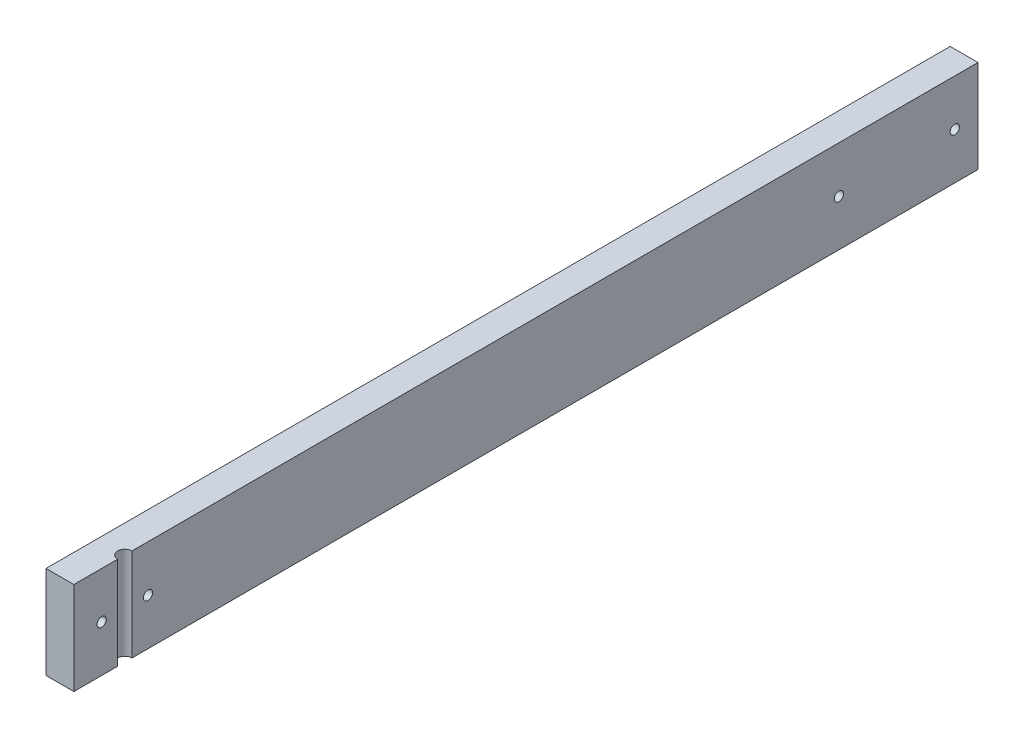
from build123d import *

# Parameters (mm, degrees)
ESQUISSE1_W             = 195
ESQUISSE1_H             = 20
EXTRUSION1_DEPTH        = 6
ESQUISSE2_R             = 1
ENL_V_MAT_EXTRU_1_DEPTH = 2
ENL_V_MAT_EXTRU_3_DEPTH = 197.11476232


with BuildPart() as part:
    # Esquisse1 → Extrusion1 (new body)
    with BuildSketch(Plane(origin=(0, 0, 0), x_dir=(0, 0, -1), z_dir=(1, 0, 0))):
        with Locations((97.5, 10)):
            Rectangle(ESQUISSE1_W, ESQUISSE1_H)
    extrude(amount=EXTRUSION1_DEPTH)

    # Esquisse2 → Enl_v. mat.-Extru.1 (cut)
    with BuildSketch(Plane(origin=(6, 0, 0), x_dir=(0, 0, -1), z_dir=(1, 0, 0))):
        with Locations((6, 10)):
            Circle(ESQUISSE2_R)
        with Locations((16, 10)):
            Circle(ESQUISSE2_R)
        with Locations((165, 10)):
            Circle(ESQUISSE2_R)
        with Locations((190, 10)):
            Circle(ESQUISSE2_R)
    extrude(amount=-ENL_V_MAT_EXTRU_1_DEPTH, mode=Mode.SUBTRACT)

    # Esquisse4 → Enl_v. mat.-Extru.3 (cut, through all)
    with BuildSketch(Plane(origin=(0, 20, 0), x_dir=(-1, 0, 0), z_dir=(0, 1, 0))):
        with BuildLine():
            Line((-6, -9.45), (-6, -12.55))
            ThreePointArc((-6, -12.55), (-4.45, -11), (-6, -9.45))
        make_face()
    extrude(amount=-ENL_V_MAT_EXTRU_3_DEPTH, mode=Mode.SUBTRACT)


solid = part.part
